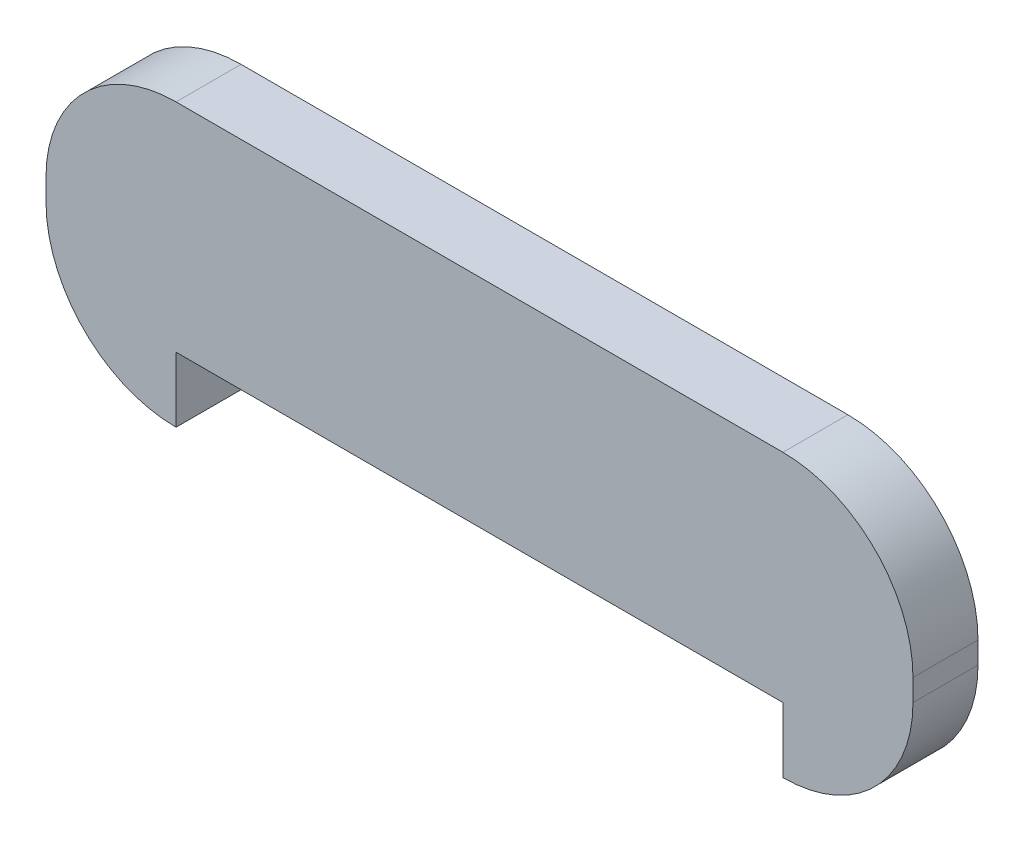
ISO-10303-21;
HEADER;
FILE_DESCRIPTION(('STEP AP214'),'2;1');
FILE_NAME('part.step','',(''),(''),'','','');
FILE_SCHEMA(('AUTOMOTIVE_DESIGN { 1 0 10303 214 1 1 1 1 }'));
ENDSEC;
DATA;
#1=APPLICATION_CONTEXT('core data for automotive mechanical design processes');
#2=APPLICATION_PROTOCOL_DEFINITION('international standard','automotive_design',2000,#1);
#3=PRODUCT_CONTEXT('',#1,'mechanical');
#4=PRODUCT('Part','Part','',(#3));
#5=PRODUCT_RELATED_PRODUCT_CATEGORY('part','',(#4));
#6=PRODUCT_DEFINITION_FORMATION('','',#4);
#7=PRODUCT_DEFINITION_CONTEXT('part definition',#1,'design');
#8=PRODUCT_DEFINITION('design','',#6,#7);
#9=PRODUCT_DEFINITION_SHAPE('','',#8);
#10=(LENGTH_UNIT() NAMED_UNIT(*) SI_UNIT(.MILLI.,.METRE.));
#11=(NAMED_UNIT(*) PLANE_ANGLE_UNIT() SI_UNIT($,.RADIAN.));
#12=(NAMED_UNIT(*) SI_UNIT($,.STERADIAN.) SOLID_ANGLE_UNIT());
#13=UNCERTAINTY_MEASURE_WITH_UNIT(LENGTH_MEASURE(1.E-05),#10,'distance_accuracy_value','');
#14=(GEOMETRIC_REPRESENTATION_CONTEXT(3) GLOBAL_UNCERTAINTY_ASSIGNED_CONTEXT((#13)) GLOBAL_UNIT_ASSIGNED_CONTEXT((#10,
#11,#12)) REPRESENTATION_CONTEXT('',''));
#15=CARTESIAN_POINT('',(0.,0.,0.));
#16=DIRECTION('',(0.,0.,1.));
#17=DIRECTION('',(1.,0.,0.));
#18=AXIS2_PLACEMENT_3D('',#15,#16,#17);
#19=CARTESIAN_POINT('',(-48.1968267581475,6.,3.));
#20=DIRECTION('',(0.,0.,-1.));
#21=DIRECTION('',(-1.,0.,0.));
#22=AXIS2_PLACEMENT_3D('',#19,#20,#21);
#23=CYLINDRICAL_SURFACE('',#22,6.);
#24=CARTESIAN_POINT('',(-48.1968267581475,6.,0.));
#25=DIRECTION('',(0.,0.,1.));
#26=DIRECTION('',(-1.,0.,0.));
#27=AXIS2_PLACEMENT_3D('',#24,#25,#26);
#28=CIRCLE('',#27,6.);
#29=CARTESIAN_POINT('',(-54.1968267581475,6.,0.));
#30=VERTEX_POINT('',#29);
#31=CARTESIAN_POINT('',(-48.1968267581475,0.,0.));
#32=VERTEX_POINT('',#31);
#33=EDGE_CURVE('E143',#30,#32,#28,.T.);
#34=ORIENTED_EDGE('',*,*,#33,.T.);
#35=DIRECTION('',(0.,0.,-1.));
#36=VECTOR('',#35,1.);
#37=CARTESIAN_POINT('',(-48.1968267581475,0.,3.));
#38=LINE('',#37,#36);
#39=CARTESIAN_POINT('',(-48.1968267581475,0.,3.));
#40=VERTEX_POINT('',#39);
#41=EDGE_CURVE('E11',#40,#32,#38,.T.);
#42=ORIENTED_EDGE('',*,*,#41,.F.);
#43=CARTESIAN_POINT('',(-48.1968267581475,6.,3.));
#44=DIRECTION('',(0.,0.,1.));
#45=DIRECTION('',(-1.,0.,0.));
#46=AXIS2_PLACEMENT_3D('',#43,#44,#45);
#47=CIRCLE('',#46,6.);
#48=CARTESIAN_POINT('',(-54.1968267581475,6.,3.));
#49=VERTEX_POINT('',#48);
#50=EDGE_CURVE('E161',#49,#40,#47,.T.);
#51=ORIENTED_EDGE('',*,*,#50,.F.);
#52=DIRECTION('',(0.,0.,-1.));
#53=VECTOR('',#52,1.);
#54=CARTESIAN_POINT('',(-54.1968267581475,6.,3.));
#55=LINE('',#54,#53);
#56=EDGE_CURVE('E139',#49,#30,#55,.T.);
#57=ORIENTED_EDGE('',*,*,#56,.T.);
#58=EDGE_LOOP('',(#34,#42,#51,#57));
#59=FACE_BOUND('',#58,.T.);
#60=ADVANCED_FACE('F35',(#59),#23,.T.);
#61=CARTESIAN_POINT('',(-48.1968267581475,0.,3.));
#62=DIRECTION('',(-1.,0.,0.));
#63=DIRECTION('',(0.,0.,1.));
#64=AXIS2_PLACEMENT_3D('',#61,#62,#63);
#65=PLANE('',#64);
#66=DIRECTION('',(0.,1.,0.));
#67=VECTOR('',#66,1.);
#68=CARTESIAN_POINT('',(-48.1968267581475,0.,0.));
#69=LINE('',#68,#67);
#70=CARTESIAN_POINT('',(-48.1968267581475,3.,0.));
#71=VERTEX_POINT('',#70);
#72=EDGE_CURVE('E146',#32,#71,#69,.T.);
#73=ORIENTED_EDGE('',*,*,#72,.T.);
#74=DIRECTION('',(0.,0.,-1.));
#75=VECTOR('',#74,1.);
#76=CARTESIAN_POINT('',(-48.1968267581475,3.,3.));
#77=LINE('',#76,#75);
#78=CARTESIAN_POINT('',(-48.1968267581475,3.,3.));
#79=VERTEX_POINT('',#78);
#80=EDGE_CURVE('E43',#79,#71,#77,.T.);
#81=ORIENTED_EDGE('',*,*,#80,.F.);
#82=DIRECTION('',(0.,1.,0.));
#83=VECTOR('',#82,1.);
#84=CARTESIAN_POINT('',(-48.1968267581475,0.,3.));
#85=LINE('',#84,#83);
#86=EDGE_CURVE('E100',#40,#79,#85,.T.);
#87=ORIENTED_EDGE('',*,*,#86,.F.);
#88=ORIENTED_EDGE('',*,*,#41,.T.);
#89=EDGE_LOOP('',(#73,#81,#87,#88));
#90=FACE_BOUND('',#89,.T.);
#91=ADVANCED_FACE('F210',(#90),#65,.F.);
#92=CARTESIAN_POINT('',(-48.1968267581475,3.,3.));
#93=DIRECTION('',(0.,1.,0.));
#94=DIRECTION('',(0.,0.,1.));
#95=AXIS2_PLACEMENT_3D('',#92,#93,#94);
#96=PLANE('',#95);
#97=DIRECTION('',(1.,0.,0.));
#98=VECTOR('',#97,1.);
#99=CARTESIAN_POINT('',(-48.1968267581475,3.,0.));
#100=LINE('',#99,#98);
#101=CARTESIAN_POINT('',(-20.1968267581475,3.,0.));
#102=VERTEX_POINT('',#101);
#103=EDGE_CURVE('E148',#71,#102,#100,.T.);
#104=ORIENTED_EDGE('',*,*,#103,.T.);
#105=DIRECTION('',(0.,0.,-1.));
#106=VECTOR('',#105,1.);
#107=CARTESIAN_POINT('',(-20.1968267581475,3.,3.));
#108=LINE('',#107,#106);
#109=CARTESIAN_POINT('',(-20.1968267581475,3.,3.));
#110=VERTEX_POINT('',#109);
#111=EDGE_CURVE('E174',#110,#102,#108,.T.);
#112=ORIENTED_EDGE('',*,*,#111,.F.);
#113=DIRECTION('',(1.,0.,0.));
#114=VECTOR('',#113,1.);
#115=CARTESIAN_POINT('',(-48.1968267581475,3.,3.));
#116=LINE('',#115,#114);
#117=EDGE_CURVE('E182',#79,#110,#116,.T.);
#118=ORIENTED_EDGE('',*,*,#117,.F.);
#119=ORIENTED_EDGE('',*,*,#80,.T.);
#120=EDGE_LOOP('',(#104,#112,#118,#119));
#121=FACE_BOUND('',#120,.T.);
#122=ADVANCED_FACE('F180',(#121),#96,.F.);
#123=CARTESIAN_POINT('',(-20.1968267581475,3.,3.));
#124=DIRECTION('',(1.,0.,0.));
#125=DIRECTION('',(0.,0.,-1.));
#126=AXIS2_PLACEMENT_3D('',#123,#124,#125);
#127=PLANE('',#126);
#128=DIRECTION('',(0.,-1.,0.));
#129=VECTOR('',#128,1.);
#130=CARTESIAN_POINT('',(-20.1968267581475,3.,0.));
#131=LINE('',#130,#129);
#132=CARTESIAN_POINT('',(-20.1968267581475,0.,0.));
#133=VERTEX_POINT('',#132);
#134=EDGE_CURVE('E150',#102,#133,#131,.T.);
#135=ORIENTED_EDGE('',*,*,#134,.T.);
#136=DIRECTION('',(0.,0.,-1.));
#137=VECTOR('',#136,1.);
#138=CARTESIAN_POINT('',(-20.1968267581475,0.,3.));
#139=LINE('',#138,#137);
#140=CARTESIAN_POINT('',(-20.1968267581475,0.,3.));
#141=VERTEX_POINT('',#140);
#142=EDGE_CURVE('E171',#141,#133,#139,.T.);
#143=ORIENTED_EDGE('',*,*,#142,.F.);
#144=DIRECTION('',(0.,-1.,0.));
#145=VECTOR('',#144,1.);
#146=CARTESIAN_POINT('',(-20.1968267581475,3.,3.));
#147=LINE('',#146,#145);
#148=EDGE_CURVE('E200',#110,#141,#147,.T.);
#149=ORIENTED_EDGE('',*,*,#148,.F.);
#150=ORIENTED_EDGE('',*,*,#111,.T.);
#151=EDGE_LOOP('',(#135,#143,#149,#150));
#152=FACE_BOUND('',#151,.T.);
#153=ADVANCED_FACE('F191',(#152),#127,.F.);
#154=CARTESIAN_POINT('',(-20.1968267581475,6.,3.));
#155=DIRECTION('',(0.,0.,-1.));
#156=DIRECTION('',(-1.,0.,0.));
#157=AXIS2_PLACEMENT_3D('',#154,#155,#156);
#158=CYLINDRICAL_SURFACE('',#157,6.);
#159=CARTESIAN_POINT('',(-20.1968267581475,6.,0.));
#160=DIRECTION('',(0.,0.,1.));
#161=DIRECTION('',(1.,0.,0.));
#162=AXIS2_PLACEMENT_3D('',#159,#160,#161);
#163=CIRCLE('',#162,6.);
#164=CARTESIAN_POINT('',(-14.1968267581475,6.,0.));
#165=VERTEX_POINT('',#164);
#166=EDGE_CURVE('E152',#133,#165,#163,.T.);
#167=ORIENTED_EDGE('',*,*,#166,.T.);
#168=DIRECTION('',(0.,0.,-1.));
#169=VECTOR('',#168,1.);
#170=CARTESIAN_POINT('',(-14.1968267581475,6.,3.));
#171=LINE('',#170,#169);
#172=CARTESIAN_POINT('',(-14.1968267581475,6.,3.));
#173=VERTEX_POINT('',#172);
#174=EDGE_CURVE('E168',#173,#165,#171,.T.);
#175=ORIENTED_EDGE('',*,*,#174,.F.);
#176=CARTESIAN_POINT('',(-20.1968267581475,6.,3.));
#177=DIRECTION('',(0.,0.,1.));
#178=DIRECTION('',(1.,0.,0.));
#179=AXIS2_PLACEMENT_3D('',#176,#177,#178);
#180=CIRCLE('',#179,6.);
#181=EDGE_CURVE('E197',#141,#173,#180,.T.);
#182=ORIENTED_EDGE('',*,*,#181,.F.);
#183=ORIENTED_EDGE('',*,*,#142,.T.);
#184=EDGE_LOOP('',(#167,#175,#182,#183));
#185=FACE_BOUND('',#184,.T.);
#186=ADVANCED_FACE('F195',(#185),#158,.T.);
#187=CARTESIAN_POINT('',(-14.1968267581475,6.,3.));
#188=DIRECTION('',(-1.,0.,0.));
#189=DIRECTION('',(0.,0.,1.));
#190=AXIS2_PLACEMENT_3D('',#187,#188,#189);
#191=PLANE('',#190);
#192=DIRECTION('',(0.,1.,0.));
#193=VECTOR('',#192,1.);
#194=CARTESIAN_POINT('',(-14.1968267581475,6.,0.));
#195=LINE('',#194,#193);
#196=CARTESIAN_POINT('',(-14.1968267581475,7.,0.));
#197=VERTEX_POINT('',#196);
#198=EDGE_CURVE('E154',#165,#197,#195,.T.);
#199=ORIENTED_EDGE('',*,*,#198,.T.);
#200=DIRECTION('',(0.,0.,-1.));
#201=VECTOR('',#200,1.);
#202=CARTESIAN_POINT('',(-14.1968267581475,7.,3.));
#203=LINE('',#202,#201);
#204=CARTESIAN_POINT('',(-14.1968267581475,7.,3.));
#205=VERTEX_POINT('',#204);
#206=EDGE_CURVE('E165',#205,#197,#203,.T.);
#207=ORIENTED_EDGE('',*,*,#206,.F.);
#208=DIRECTION('',(0.,1.,0.));
#209=VECTOR('',#208,1.);
#210=CARTESIAN_POINT('',(-14.1968267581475,6.,3.));
#211=LINE('',#210,#209);
#212=EDGE_CURVE('E199',#173,#205,#211,.T.);
#213=ORIENTED_EDGE('',*,*,#212,.F.);
#214=ORIENTED_EDGE('',*,*,#174,.T.);
#215=EDGE_LOOP('',(#199,#207,#213,#214));
#216=FACE_BOUND('',#215,.T.);
#217=ADVANCED_FACE('F222',(#216),#191,.F.);
#218=CARTESIAN_POINT('',(-20.1968267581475,7.,3.));
#219=DIRECTION('',(0.,0.,-1.));
#220=DIRECTION('',(-1.,0.,0.));
#221=AXIS2_PLACEMENT_3D('',#218,#219,#220);
#222=CYLINDRICAL_SURFACE('',#221,6.);
#223=CARTESIAN_POINT('',(-20.1968267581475,7.,0.));
#224=DIRECTION('',(0.,0.,1.));
#225=DIRECTION('',(-1.,0.,0.));
#226=AXIS2_PLACEMENT_3D('',#223,#224,#225);
#227=CIRCLE('',#226,6.);
#228=CARTESIAN_POINT('',(-20.1968267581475,13.,0.));
#229=VERTEX_POINT('',#228);
#230=EDGE_CURVE('E156',#197,#229,#227,.T.);
#231=ORIENTED_EDGE('',*,*,#230,.T.);
#232=DIRECTION('',(0.,0.,-1.));
#233=VECTOR('',#232,1.);
#234=CARTESIAN_POINT('',(-20.1968267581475,13.,3.));
#235=LINE('',#234,#233);
#236=CARTESIAN_POINT('',(-20.1968267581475,13.,3.));
#237=VERTEX_POINT('',#236);
#238=EDGE_CURVE('E134',#237,#229,#235,.T.);
#239=ORIENTED_EDGE('',*,*,#238,.F.);
#240=CARTESIAN_POINT('',(-20.1968267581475,7.,3.));
#241=DIRECTION('',(0.,0.,1.));
#242=DIRECTION('',(-1.,0.,0.));
#243=AXIS2_PLACEMENT_3D('',#240,#241,#242);
#244=CIRCLE('',#243,6.);
#245=EDGE_CURVE('E125',#205,#237,#244,.T.);
#246=ORIENTED_EDGE('',*,*,#245,.F.);
#247=ORIENTED_EDGE('',*,*,#206,.T.);
#248=EDGE_LOOP('',(#231,#239,#246,#247));
#249=FACE_BOUND('',#248,.T.);
#250=ADVANCED_FACE('F225',(#249),#222,.T.);
#251=CARTESIAN_POINT('',(-48.1968267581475,13.,3.));
#252=DIRECTION('',(0.,-1.,0.));
#253=DIRECTION('',(0.,0.,-1.));
#254=AXIS2_PLACEMENT_3D('',#251,#252,#253);
#255=PLANE('',#254);
#256=DIRECTION('',(-1.,0.,0.));
#257=VECTOR('',#256,1.);
#258=CARTESIAN_POINT('',(-48.1968267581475,13.,0.));
#259=LINE('',#258,#257);
#260=CARTESIAN_POINT('',(-48.1968267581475,13.,0.));
#261=VERTEX_POINT('',#260);
#262=EDGE_CURVE('E133',#229,#261,#259,.T.);
#263=ORIENTED_EDGE('',*,*,#262,.T.);
#264=DIRECTION('',(0.,0.,-1.));
#265=VECTOR('',#264,1.);
#266=CARTESIAN_POINT('',(-48.1968267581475,13.,3.));
#267=LINE('',#266,#265);
#268=CARTESIAN_POINT('',(-48.1968267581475,13.,3.));
#269=VERTEX_POINT('',#268);
#270=EDGE_CURVE('E130',#269,#261,#267,.T.);
#271=ORIENTED_EDGE('',*,*,#270,.F.);
#272=DIRECTION('',(-1.,0.,0.));
#273=VECTOR('',#272,1.);
#274=CARTESIAN_POINT('',(-48.1968267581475,13.,3.));
#275=LINE('',#274,#273);
#276=EDGE_CURVE('E119',#237,#269,#275,.T.);
#277=ORIENTED_EDGE('',*,*,#276,.F.);
#278=ORIENTED_EDGE('',*,*,#238,.T.);
#279=EDGE_LOOP('',(#263,#271,#277,#278));
#280=FACE_BOUND('',#279,.T.);
#281=ADVANCED_FACE('F131',(#280),#255,.F.);
#282=CARTESIAN_POINT('',(-48.1968267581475,7.,3.));
#283=DIRECTION('',(0.,0.,-1.));
#284=DIRECTION('',(-1.,0.,0.));
#285=AXIS2_PLACEMENT_3D('',#282,#283,#284);
#286=CYLINDRICAL_SURFACE('',#285,6.);
#287=CARTESIAN_POINT('',(-48.1968267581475,7.,0.));
#288=DIRECTION('',(0.,0.,1.));
#289=DIRECTION('',(-1.,0.,0.));
#290=AXIS2_PLACEMENT_3D('',#287,#288,#289);
#291=CIRCLE('',#290,6.);
#292=CARTESIAN_POINT('',(-54.1968267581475,7.,0.));
#293=VERTEX_POINT('',#292);
#294=EDGE_CURVE('E86',#261,#293,#291,.T.);
#295=ORIENTED_EDGE('',*,*,#294,.T.);
#296=DIRECTION('',(0.,0.,-1.));
#297=VECTOR('',#296,1.);
#298=CARTESIAN_POINT('',(-54.1968267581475,7.,3.));
#299=LINE('',#298,#297);
#300=CARTESIAN_POINT('',(-54.1968267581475,7.,3.));
#301=VERTEX_POINT('',#300);
#302=EDGE_CURVE('E135',#301,#293,#299,.T.);
#303=ORIENTED_EDGE('',*,*,#302,.F.);
#304=CARTESIAN_POINT('',(-48.1968267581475,7.,3.));
#305=DIRECTION('',(0.,0.,1.));
#306=DIRECTION('',(-1.,0.,0.));
#307=AXIS2_PLACEMENT_3D('',#304,#305,#306);
#308=CIRCLE('',#307,6.);
#309=EDGE_CURVE('E123',#269,#301,#308,.T.);
#310=ORIENTED_EDGE('',*,*,#309,.F.);
#311=ORIENTED_EDGE('',*,*,#270,.T.);
#312=EDGE_LOOP('',(#295,#303,#310,#311));
#313=FACE_BOUND('',#312,.T.);
#314=ADVANCED_FACE('F137',(#313),#286,.T.);
#315=CARTESIAN_POINT('',(-54.1968267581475,6.,3.));
#316=DIRECTION('',(1.,0.,0.));
#317=DIRECTION('',(0.,0.,-1.));
#318=AXIS2_PLACEMENT_3D('',#315,#316,#317);
#319=PLANE('',#318);
#320=DIRECTION('',(0.,-1.,0.));
#321=VECTOR('',#320,1.);
#322=CARTESIAN_POINT('',(-54.1968267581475,6.,0.));
#323=LINE('',#322,#321);
#324=EDGE_CURVE('E92',#293,#30,#323,.T.);
#325=ORIENTED_EDGE('',*,*,#324,.T.);
#326=ORIENTED_EDGE('',*,*,#56,.F.);
#327=DIRECTION('',(0.,-1.,0.));
#328=VECTOR('',#327,1.);
#329=CARTESIAN_POINT('',(-54.1968267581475,6.,3.));
#330=LINE('',#329,#328);
#331=EDGE_CURVE('E51',#301,#49,#330,.T.);
#332=ORIENTED_EDGE('',*,*,#331,.F.);
#333=ORIENTED_EDGE('',*,*,#302,.T.);
#334=EDGE_LOOP('',(#325,#326,#332,#333));
#335=FACE_BOUND('',#334,.T.);
#336=ADVANCED_FACE('F234',(#335),#319,.F.);
#337=CARTESIAN_POINT('',(-48.1968267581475,6.,3.));
#338=DIRECTION('',(0.,0.,-1.));
#339=DIRECTION('',(-1.,0.,0.));
#340=AXIS2_PLACEMENT_3D('',#337,#338,#339);
#341=PLANE('',#340);
#342=ORIENTED_EDGE('',*,*,#50,.T.);
#343=ORIENTED_EDGE('',*,*,#86,.T.);
#344=ORIENTED_EDGE('',*,*,#117,.T.);
#345=ORIENTED_EDGE('',*,*,#148,.T.);
#346=ORIENTED_EDGE('',*,*,#181,.T.);
#347=ORIENTED_EDGE('',*,*,#212,.T.);
#348=ORIENTED_EDGE('',*,*,#245,.T.);
#349=ORIENTED_EDGE('',*,*,#276,.T.);
#350=ORIENTED_EDGE('',*,*,#309,.T.);
#351=ORIENTED_EDGE('',*,*,#331,.T.);
#352=EDGE_LOOP('',(#342,#343,#344,#345,#346,#347,#348,#349,#350,#351));
#353=FACE_BOUND('',#352,.T.);
#354=ADVANCED_FACE('F121',(#353),#341,.F.);
#355=CARTESIAN_POINT('',(-48.1968267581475,6.,0.));
#356=DIRECTION('',(0.,0.,-1.));
#357=DIRECTION('',(-1.,0.,0.));
#358=AXIS2_PLACEMENT_3D('',#355,#356,#357);
#359=PLANE('',#358);
#360=ORIENTED_EDGE('',*,*,#33,.F.);
#361=ORIENTED_EDGE('',*,*,#324,.F.);
#362=ORIENTED_EDGE('',*,*,#294,.F.);
#363=ORIENTED_EDGE('',*,*,#262,.F.);
#364=ORIENTED_EDGE('',*,*,#230,.F.);
#365=ORIENTED_EDGE('',*,*,#198,.F.);
#366=ORIENTED_EDGE('',*,*,#166,.F.);
#367=ORIENTED_EDGE('',*,*,#134,.F.);
#368=ORIENTED_EDGE('',*,*,#103,.F.);
#369=ORIENTED_EDGE('',*,*,#72,.F.);
#370=EDGE_LOOP('',(#360,#361,#362,#363,#364,#365,#366,#367,#368,#369));
#371=FACE_BOUND('',#370,.T.);
#372=ADVANCED_FACE('F186',(#371),#359,.T.);
#373=CLOSED_SHELL('',(#60,#91,#122,#153,#186,#217,#250,#281,#314,#336,#354,#372));
#374=MANIFOLD_SOLID_BREP('B2',#373);
#375=ADVANCED_BREP_SHAPE_REPRESENTATION('',(#18,#374),#14);
#376=SHAPE_DEFINITION_REPRESENTATION(#9,#375);
ENDSEC;
END-ISO-10303-21;
